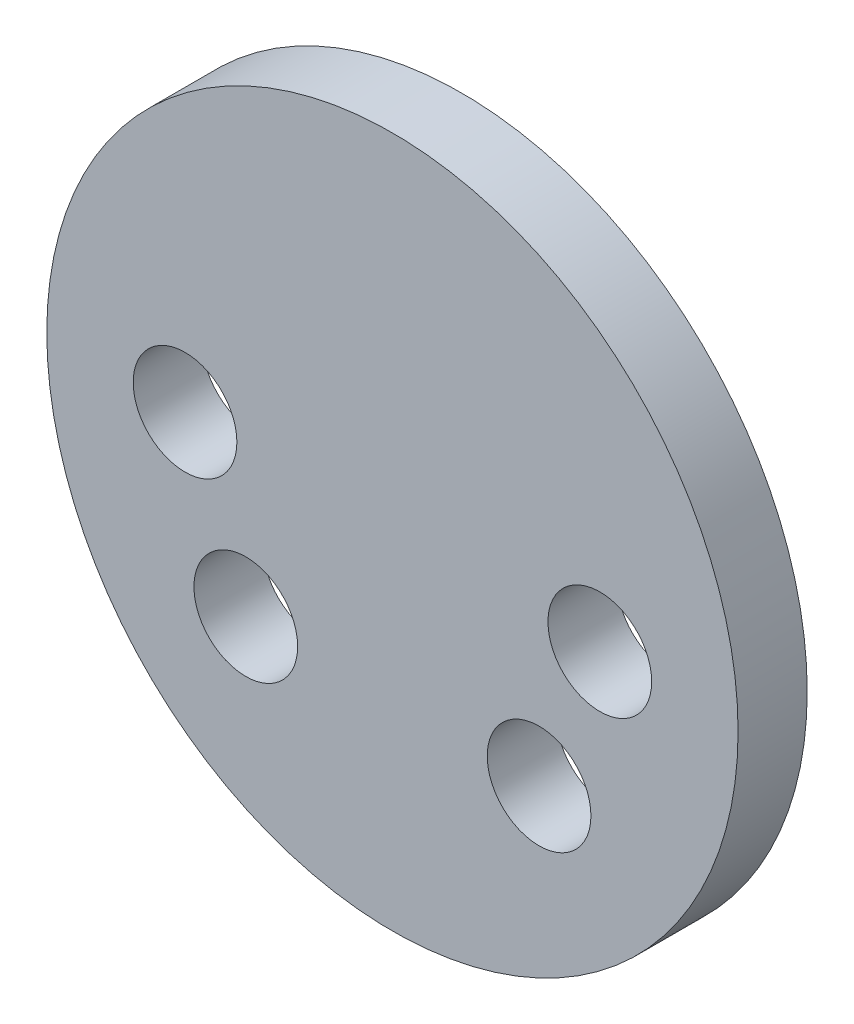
from build123d import *

# Parameters (mm, degrees)
SKETCH1_R      = 50
SKETCH1_R_2    = 7.5
EXTRUDE1_DEPTH = 10


with BuildPart() as part:
    # Sketch1 → Extrude1 (new body)
    with BuildSketch(Plane.XY):
        Circle(SKETCH1_R)
        with Locations((-30, 0)):
            Circle(SKETCH1_R_2, mode=Mode.SUBTRACT)
        with Locations((-21.213203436, -21.213203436)):
            Circle(SKETCH1_R_2, mode=Mode.SUBTRACT)
        with Locations((21.213203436, -21.213203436)):
            Circle(SKETCH1_R_2, mode=Mode.SUBTRACT)
        with Locations((30, 0)):
            Circle(SKETCH1_R_2, mode=Mode.SUBTRACT)
    extrude(amount=EXTRUDE1_DEPTH)


solid = part.part
